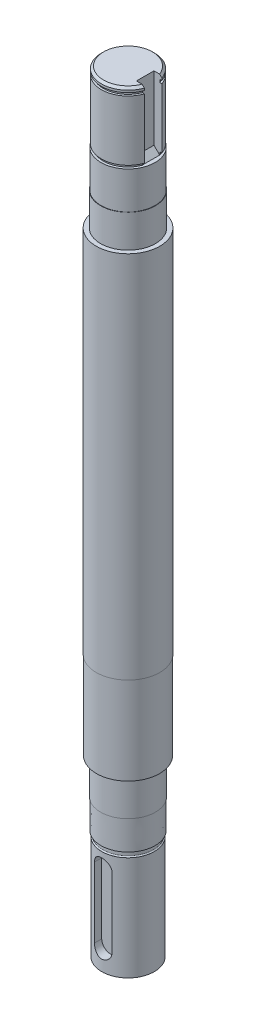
from build123d import *

# Parameters (mm, degrees)
CHAMFER_2_SIZE      = 1
CUT_EXTRUDE_1_DEPTH = 4
SKETCH_8_W          = 8
SKETCH_8_H          = 32
CUT_EXTRUDE_3_DEPTH = 4.3
CHAMFER_3_SIZE      = 2.6


with BuildPart() as part:
    # Sketch 1 → Revolve 2 (revolve)
    with BuildSketch(Plane.XY, mode=Mode.PRIVATE) as revolve_2_sk:
        Polygon((0, 0), (12, 0), (12, 50), (12.35, 50), (12.342707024, 63.3), (12.5, 63.3), (12.5, 79.5), (14.4, 79.5), (14.4, 119.5), (14.5, 119.5), (14.5, 288), (12.5, 288), (12.5, 303), (12.35, 303), (12.35, 320), (11.257292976, 320), (11.257292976, 321.3), (12.15, 321.3), (12.15, 348.7), (11.25, 348.7), (11.25, 350), (12.15, 350), (12.15, 352), (0, 352), align=None)
    revolve(revolve_2_sk.sketch.rotate(Axis((0, 326.056951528, 0), (0, 1, 0)), 90), axis=Axis((0, 326.056951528, 0), (0, 1, 0)))

    # Chamfer 2
    chamfer_2_edges = [part.edges().sort_by_distance(p)[0] for p in [
        (0, 352, 12.15),
    ]]
    chamfer(chamfer_2_edges, length=CHAMFER_2_SIZE)

    # Sketch 5 → Cut-Revolve 1 (revolve, cut)
    with BuildSketch(Plane.XY, mode=Mode.PRIVATE) as cut_revolve_1_sk:
        with BuildLine():
            Line((12, 50), (12, 47.5))
            Line((12, 47.5), (11.99, 47.5))
            ThreePointArc((11.99, 47.5), (11.643517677, 47.643517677), (11.5, 47.99))
            Line((11.5, 47.99), (11.5, 49.51))
            ThreePointArc((11.5, 49.51), (11.643517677, 49.856482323), (11.99, 50))
            Line((11.99, 50), (12, 50))
        make_face()
    revolve(cut_revolve_1_sk.sketch.rotate(Axis((0, 0, 0), (0, 1, 0)), 90), axis=Axis((0, 0, 0), (0, 1, 0)), mode=Mode.SUBTRACT)

    # Sketch 6 → Cut-Extrude 1 (cut)
    with BuildSketch(Plane.XY.offset(12)):
        with BuildLine():
            Line((-4, 9), (-4, 41))
            ThreePointArc((-4, 41), (0, 45), (4, 41))
            Line((4, 41), (4, 9))
            ThreePointArc((4, 9), (0, 5), (-4, 9))
        make_face()
    extrude(amount=-CUT_EXTRUDE_1_DEPTH, mode=Mode.SUBTRACT)

    # Sketch 8 → Cut-Extrude 3 (cut)
    with BuildSketch(Plane(origin=(12.15, 0, 0), x_dir=(0, 0, -1), z_dir=(1, 0, 0))):
        with Locations((0, 336)):
            Rectangle(SKETCH_8_W, SKETCH_8_H)
    extrude(amount=-CUT_EXTRUDE_3_DEPTH, mode=Mode.SUBTRACT)

    # Chamfer 3
    chamfer_3_edges = [part.edges().sort_by_distance(p)[0] for p in [
        (7.85, 320, 0),
    ]]
    chamfer(chamfer_3_edges, length=CHAMFER_3_SIZE)


solid = part.part
